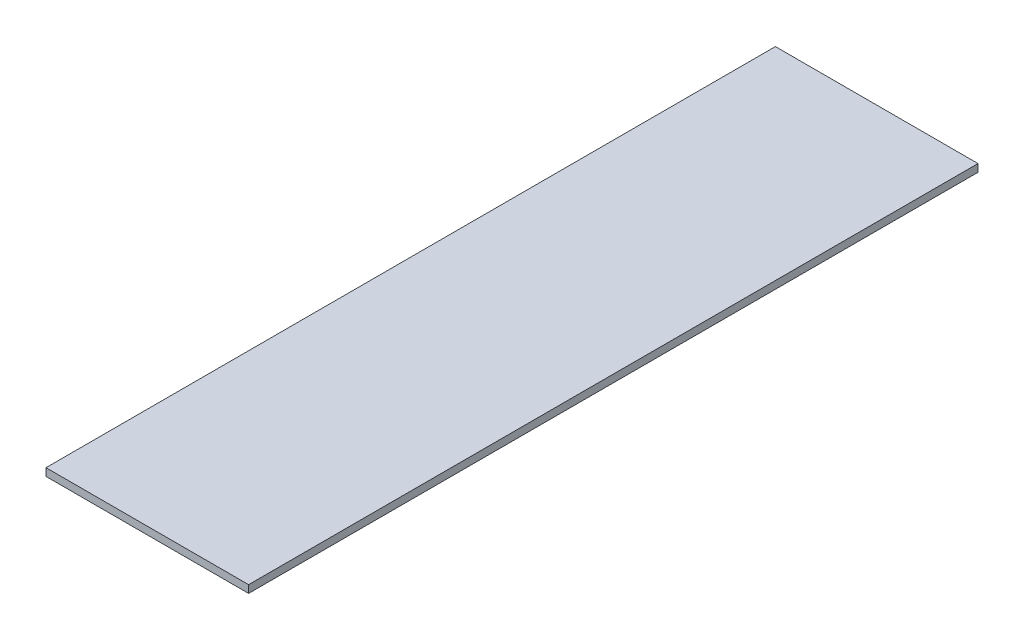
from build123d import *

# Parameters (mm, degrees)
SKETCH1_W           = 127
SKETCH1_H           = 457.2
BOSS_EXTRUDE1_DEPTH = 4.7625


with BuildPart() as part:
    # Sketch1 → Boss-Extrude1 (new body)
    with BuildSketch(Plane(origin=(0, 0, 0), x_dir=(1, 0, 0), z_dir=(0, 1, 0))):
        with Locations((63.5, 228.6)):
            Rectangle(SKETCH1_W, SKETCH1_H)
    extrude(amount=BOSS_EXTRUDE1_DEPTH)


solid = part.part
